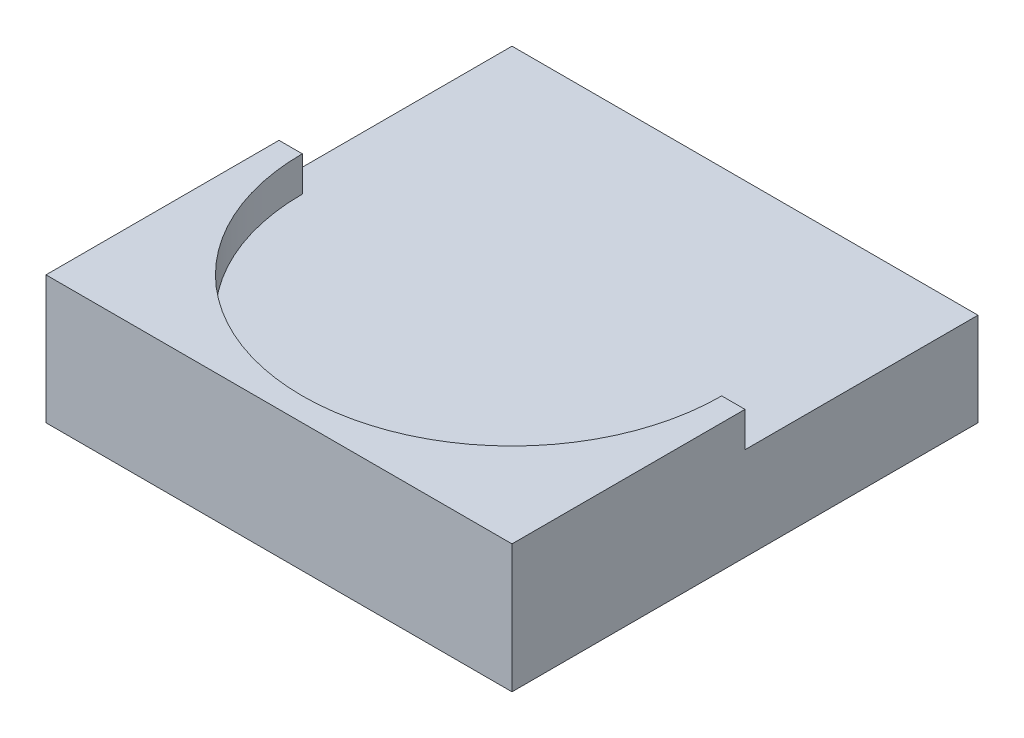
ISO-10303-21;
HEADER;
FILE_DESCRIPTION(('STEP AP214'),'2;1');
FILE_NAME('part.step','',(''),(''),'','','');
FILE_SCHEMA(('AUTOMOTIVE_DESIGN { 1 0 10303 214 1 1 1 1 }'));
ENDSEC;
DATA;
#1=APPLICATION_CONTEXT('core data for automotive mechanical design processes');
#2=APPLICATION_PROTOCOL_DEFINITION('international standard','automotive_design',2000,#1);
#3=PRODUCT_CONTEXT('',#1,'mechanical');
#4=PRODUCT('Part','Part','',(#3));
#5=PRODUCT_RELATED_PRODUCT_CATEGORY('part','',(#4));
#6=PRODUCT_DEFINITION_FORMATION('','',#4);
#7=PRODUCT_DEFINITION_CONTEXT('part definition',#1,'design');
#8=PRODUCT_DEFINITION('design','',#6,#7);
#9=PRODUCT_DEFINITION_SHAPE('','',#8);
#10=(LENGTH_UNIT() NAMED_UNIT(*) SI_UNIT(.MILLI.,.METRE.));
#11=(NAMED_UNIT(*) PLANE_ANGLE_UNIT() SI_UNIT($,.RADIAN.));
#12=(NAMED_UNIT(*) SI_UNIT($,.STERADIAN.) SOLID_ANGLE_UNIT());
#13=UNCERTAINTY_MEASURE_WITH_UNIT(LENGTH_MEASURE(1.E-05),#10,'distance_accuracy_value','');
#14=(GEOMETRIC_REPRESENTATION_CONTEXT(3) GLOBAL_UNCERTAINTY_ASSIGNED_CONTEXT((#13)) GLOBAL_UNIT_ASSIGNED_CONTEXT((#10,
#11,#12)) REPRESENTATION_CONTEXT('',''));
#15=CARTESIAN_POINT('',(0.,0.,0.));
#16=DIRECTION('',(0.,0.,1.));
#17=DIRECTION('',(1.,0.,0.));
#18=AXIS2_PLACEMENT_3D('',#15,#16,#17);
#19=CARTESIAN_POINT('',(0.,1.1,0.));
#20=DIRECTION('',(0.,0.,1.));
#21=DIRECTION('',(1.,0.,0.));
#22=AXIS2_PLACEMENT_3D('',#19,#20,#21);
#23=PLANE('',#22);
#24=DIRECTION('',(-1.,0.,0.));
#25=VECTOR('',#24,1.);
#26=CARTESIAN_POINT('',(0.,0.8,0.));
#27=LINE('',#26,#25);
#28=CARTESIAN_POINT('',(4.,0.8,0.));
#29=VERTEX_POINT('',#28);
#30=CARTESIAN_POINT('',(0.,0.8,0.));
#31=VERTEX_POINT('',#30);
#32=EDGE_CURVE('E145',#29,#31,#27,.T.);
#33=ORIENTED_EDGE('',*,*,#32,.F.);
#34=DIRECTION('',(0.,-1.,0.));
#35=VECTOR('',#34,1.);
#36=CARTESIAN_POINT('',(4.,1.1,0.));
#37=LINE('',#36,#35);
#38=CARTESIAN_POINT('',(4.,0.,0.));
#39=VERTEX_POINT('',#38);
#40=EDGE_CURVE('E88',#29,#39,#37,.T.);
#41=ORIENTED_EDGE('',*,*,#40,.T.);
#42=DIRECTION('',(-1.,0.,0.));
#43=VECTOR('',#42,1.);
#44=CARTESIAN_POINT('',(0.,0.,0.));
#45=LINE('',#44,#43);
#46=CARTESIAN_POINT('',(0.,0.,0.));
#47=VERTEX_POINT('',#46);
#48=EDGE_CURVE('E92',#39,#47,#45,.T.);
#49=ORIENTED_EDGE('',*,*,#48,.T.);
#50=DIRECTION('',(0.,-1.,0.));
#51=VECTOR('',#50,1.);
#52=CARTESIAN_POINT('',(0.,1.1,0.));
#53=LINE('',#52,#51);
#54=EDGE_CURVE('E76',#31,#47,#53,.T.);
#55=ORIENTED_EDGE('',*,*,#54,.F.);
#56=EDGE_LOOP('',(#33,#41,#49,#55));
#57=FACE_BOUND('',#56,.T.);
#58=ADVANCED_FACE('F32',(#57),#23,.F.);
#59=CARTESIAN_POINT('',(0.,1.1,0.));
#60=DIRECTION('',(1.,0.,0.));
#61=DIRECTION('',(0.,0.,-1.));
#62=AXIS2_PLACEMENT_3D('',#59,#60,#61);
#63=PLANE('',#62);
#64=DIRECTION('',(0.,0.,1.));
#65=VECTOR('',#64,1.);
#66=CARTESIAN_POINT('',(0.,1.1,0.));
#67=LINE('',#66,#65);
#68=CARTESIAN_POINT('',(0.,1.1,2.));
#69=VERTEX_POINT('',#68);
#70=CARTESIAN_POINT('',(0.,1.1,4.));
#71=VERTEX_POINT('',#70);
#72=EDGE_CURVE('E97',#69,#71,#67,.T.);
#73=ORIENTED_EDGE('',*,*,#72,.F.);
#74=DIRECTION('',(0.,1.,0.));
#75=VECTOR('',#74,1.);
#76=CARTESIAN_POINT('',(0.,0.8,2.));
#77=LINE('',#76,#75);
#78=CARTESIAN_POINT('',(0.,0.8,2.));
#79=VERTEX_POINT('',#78);
#80=EDGE_CURVE('E105',#79,#69,#77,.T.);
#81=ORIENTED_EDGE('',*,*,#80,.F.);
#82=DIRECTION('',(0.,0.,1.));
#83=VECTOR('',#82,1.);
#84=CARTESIAN_POINT('',(0.,0.8,2.));
#85=LINE('',#84,#83);
#86=EDGE_CURVE('E85',#31,#79,#85,.T.);
#87=ORIENTED_EDGE('',*,*,#86,.F.);
#88=ORIENTED_EDGE('',*,*,#54,.T.);
#89=DIRECTION('',(0.,0.,1.));
#90=VECTOR('',#89,1.);
#91=CARTESIAN_POINT('',(0.,0.,0.));
#92=LINE('',#91,#90);
#93=CARTESIAN_POINT('',(0.,0.,4.));
#94=VERTEX_POINT('',#93);
#95=EDGE_CURVE('E81',#47,#94,#92,.T.);
#96=ORIENTED_EDGE('',*,*,#95,.T.);
#97=DIRECTION('',(0.,-1.,0.));
#98=VECTOR('',#97,1.);
#99=CARTESIAN_POINT('',(0.,1.1,4.));
#100=LINE('',#99,#98);
#101=EDGE_CURVE('E11',#71,#94,#100,.T.);
#102=ORIENTED_EDGE('',*,*,#101,.F.);
#103=EDGE_LOOP('',(#73,#81,#87,#88,#96,#102));
#104=FACE_BOUND('',#103,.T.);
#105=ADVANCED_FACE('F34',(#104),#63,.F.);
#106=CARTESIAN_POINT('',(0.,1.1,4.));
#107=DIRECTION('',(0.,0.,-1.));
#108=DIRECTION('',(-1.,0.,0.));
#109=AXIS2_PLACEMENT_3D('',#106,#107,#108);
#110=PLANE('',#109);
#111=DIRECTION('',(1.,0.,0.));
#112=VECTOR('',#111,1.);
#113=CARTESIAN_POINT('',(0.,0.,4.));
#114=LINE('',#113,#112);
#115=CARTESIAN_POINT('',(4.,0.,4.));
#116=VERTEX_POINT('',#115);
#117=EDGE_CURVE('E101',#94,#116,#114,.T.);
#118=ORIENTED_EDGE('',*,*,#117,.T.);
#119=DIRECTION('',(0.,-1.,0.));
#120=VECTOR('',#119,1.);
#121=CARTESIAN_POINT('',(4.,1.1,4.));
#122=LINE('',#121,#120);
#123=CARTESIAN_POINT('',(4.,1.1,4.));
#124=VERTEX_POINT('',#123);
#125=EDGE_CURVE('E40',#124,#116,#122,.T.);
#126=ORIENTED_EDGE('',*,*,#125,.F.);
#127=DIRECTION('',(1.,0.,0.));
#128=VECTOR('',#127,1.);
#129=CARTESIAN_POINT('',(0.,1.1,4.));
#130=LINE('',#129,#128);
#131=EDGE_CURVE('E56',#71,#124,#130,.T.);
#132=ORIENTED_EDGE('',*,*,#131,.F.);
#133=ORIENTED_EDGE('',*,*,#101,.T.);
#134=EDGE_LOOP('',(#118,#126,#132,#133));
#135=FACE_BOUND('',#134,.T.);
#136=ADVANCED_FACE('F118',(#135),#110,.F.);
#137=CARTESIAN_POINT('',(4.,1.1,0.));
#138=DIRECTION('',(-1.,0.,0.));
#139=DIRECTION('',(0.,0.,1.));
#140=AXIS2_PLACEMENT_3D('',#137,#138,#139);
#141=PLANE('',#140);
#142=DIRECTION('',(0.,0.,-1.));
#143=VECTOR('',#142,1.);
#144=CARTESIAN_POINT('',(4.,0.8,0.));
#145=LINE('',#144,#143);
#146=CARTESIAN_POINT('',(4.,0.8,2.));
#147=VERTEX_POINT('',#146);
#148=EDGE_CURVE('E148',#147,#29,#145,.T.);
#149=ORIENTED_EDGE('',*,*,#148,.F.);
#150=DIRECTION('',(0.,1.,0.));
#151=VECTOR('',#150,1.);
#152=CARTESIAN_POINT('',(4.,0.8,2.));
#153=LINE('',#152,#151);
#154=CARTESIAN_POINT('',(4.,1.1,2.));
#155=VERTEX_POINT('',#154);
#156=EDGE_CURVE('E130',#147,#155,#153,.T.);
#157=ORIENTED_EDGE('',*,*,#156,.T.);
#158=DIRECTION('',(0.,0.,-1.));
#159=VECTOR('',#158,1.);
#160=CARTESIAN_POINT('',(4.,1.1,0.));
#161=LINE('',#160,#159);
#162=EDGE_CURVE('E89',#124,#155,#161,.T.);
#163=ORIENTED_EDGE('',*,*,#162,.F.);
#164=ORIENTED_EDGE('',*,*,#125,.T.);
#165=DIRECTION('',(0.,0.,-1.));
#166=VECTOR('',#165,1.);
#167=CARTESIAN_POINT('',(4.,0.,0.));
#168=LINE('',#167,#166);
#169=EDGE_CURVE('E98',#116,#39,#168,.T.);
#170=ORIENTED_EDGE('',*,*,#169,.T.);
#171=ORIENTED_EDGE('',*,*,#40,.F.);
#172=EDGE_LOOP('',(#149,#157,#163,#164,#170,#171));
#173=FACE_BOUND('',#172,.T.);
#174=ADVANCED_FACE('F115',(#173),#141,.F.);
#175=CARTESIAN_POINT('',(0.,1.1,0.));
#176=DIRECTION('',(0.,1.,0.));
#177=DIRECTION('',(0.,0.,1.));
#178=AXIS2_PLACEMENT_3D('',#175,#176,#177);
#179=PLANE('',#178);
#180=DIRECTION('',(1.,0.,0.));
#181=VECTOR('',#180,1.);
#182=CARTESIAN_POINT('',(0.2,1.1,2.));
#183=LINE('',#182,#181);
#184=CARTESIAN_POINT('',(0.2,1.1,2.));
#185=VERTEX_POINT('',#184);
#186=EDGE_CURVE('E134',#69,#185,#183,.T.);
#187=ORIENTED_EDGE('',*,*,#186,.F.);
#188=ORIENTED_EDGE('',*,*,#72,.T.);
#189=ORIENTED_EDGE('',*,*,#131,.T.);
#190=ORIENTED_EDGE('',*,*,#162,.T.);
#191=DIRECTION('',(1.,0.,0.));
#192=VECTOR('',#191,1.);
#193=CARTESIAN_POINT('',(4.,1.1,2.));
#194=LINE('',#193,#192);
#195=CARTESIAN_POINT('',(3.8,1.1,2.));
#196=VERTEX_POINT('',#195);
#197=EDGE_CURVE('E138',#196,#155,#194,.T.);
#198=ORIENTED_EDGE('',*,*,#197,.F.);
#199=CARTESIAN_POINT('',(2.,1.1,2.));
#200=DIRECTION('',(0.,1.,0.));
#201=DIRECTION('',(0.,0.,1.));
#202=AXIS2_PLACEMENT_3D('',#199,#200,#201);
#203=CIRCLE('',#202,1.8);
#204=EDGE_CURVE('E47',#185,#196,#203,.T.);
#205=ORIENTED_EDGE('',*,*,#204,.F.);
#206=EDGE_LOOP('',(#187,#188,#189,#190,#198,#205));
#207=FACE_BOUND('',#206,.T.);
#208=ADVANCED_FACE('F174',(#207),#179,.T.);
#209=CARTESIAN_POINT('',(0.,0.,0.));
#210=DIRECTION('',(0.,1.,0.));
#211=DIRECTION('',(0.,0.,1.));
#212=AXIS2_PLACEMENT_3D('',#209,#210,#211);
#213=PLANE('',#212);
#214=ORIENTED_EDGE('',*,*,#95,.F.);
#215=ORIENTED_EDGE('',*,*,#48,.F.);
#216=ORIENTED_EDGE('',*,*,#169,.F.);
#217=ORIENTED_EDGE('',*,*,#117,.F.);
#218=EDGE_LOOP('',(#214,#215,#216,#217));
#219=FACE_BOUND('',#218,.T.);
#220=ADVANCED_FACE('F100',(#219),#213,.F.);
#221=CARTESIAN_POINT('',(2.,0.8,2.));
#222=DIRECTION('',(0.,1.,0.));
#223=DIRECTION('',(0.,0.,1.));
#224=AXIS2_PLACEMENT_3D('',#221,#222,#223);
#225=CYLINDRICAL_SURFACE('',#224,1.8);
#226=ORIENTED_EDGE('',*,*,#204,.T.);
#227=DIRECTION('',(0.,1.,0.));
#228=VECTOR('',#227,1.);
#229=CARTESIAN_POINT('',(3.8,0.8,2.));
#230=LINE('',#229,#228);
#231=CARTESIAN_POINT('',(3.8,0.8,2.));
#232=VERTEX_POINT('',#231);
#233=EDGE_CURVE('E128',#232,#196,#230,.T.);
#234=ORIENTED_EDGE('',*,*,#233,.F.);
#235=CARTESIAN_POINT('',(2.,0.8,2.));
#236=DIRECTION('',(0.,1.,0.));
#237=DIRECTION('',(0.,0.,1.));
#238=AXIS2_PLACEMENT_3D('',#235,#236,#237);
#239=CIRCLE('',#238,1.8);
#240=CARTESIAN_POINT('',(0.2,0.8,2.));
#241=VERTEX_POINT('',#240);
#242=EDGE_CURVE('E137',#241,#232,#239,.T.);
#243=ORIENTED_EDGE('',*,*,#242,.F.);
#244=DIRECTION('',(0.,1.,0.));
#245=VECTOR('',#244,1.);
#246=CARTESIAN_POINT('',(0.2,0.8,2.));
#247=LINE('',#246,#245);
#248=EDGE_CURVE('E102',#241,#185,#247,.T.);
#249=ORIENTED_EDGE('',*,*,#248,.T.);
#250=EDGE_LOOP('',(#226,#234,#243,#249));
#251=FACE_BOUND('',#250,.T.);
#252=ADVANCED_FACE('F163',(#251),#225,.F.);
#253=CARTESIAN_POINT('',(0.2,0.8,2.));
#254=DIRECTION('',(0.,0.,1.));
#255=DIRECTION('',(1.,0.,0.));
#256=AXIS2_PLACEMENT_3D('',#253,#254,#255);
#257=PLANE('',#256);
#258=ORIENTED_EDGE('',*,*,#186,.T.);
#259=ORIENTED_EDGE('',*,*,#248,.F.);
#260=DIRECTION('',(1.,0.,0.));
#261=VECTOR('',#260,1.);
#262=CARTESIAN_POINT('',(0.2,0.8,2.));
#263=LINE('',#262,#261);
#264=EDGE_CURVE('E131',#79,#241,#263,.T.);
#265=ORIENTED_EDGE('',*,*,#264,.F.);
#266=ORIENTED_EDGE('',*,*,#80,.T.);
#267=EDGE_LOOP('',(#258,#259,#265,#266));
#268=FACE_BOUND('',#267,.T.);
#269=ADVANCED_FACE('F215',(#268),#257,.F.);
#270=CARTESIAN_POINT('',(4.,0.8,2.));
#271=DIRECTION('',(0.,0.,1.));
#272=DIRECTION('',(1.,0.,0.));
#273=AXIS2_PLACEMENT_3D('',#270,#271,#272);
#274=PLANE('',#273);
#275=ORIENTED_EDGE('',*,*,#197,.T.);
#276=ORIENTED_EDGE('',*,*,#156,.F.);
#277=DIRECTION('',(1.,0.,0.));
#278=VECTOR('',#277,1.);
#279=CARTESIAN_POINT('',(4.,0.8,2.));
#280=LINE('',#279,#278);
#281=EDGE_CURVE('E151',#232,#147,#280,.T.);
#282=ORIENTED_EDGE('',*,*,#281,.F.);
#283=ORIENTED_EDGE('',*,*,#233,.T.);
#284=EDGE_LOOP('',(#275,#276,#282,#283));
#285=FACE_BOUND('',#284,.T.);
#286=ADVANCED_FACE('F173',(#285),#274,.F.);
#287=CARTESIAN_POINT('',(2.,0.8,2.));
#288=DIRECTION('',(0.,1.,0.));
#289=DIRECTION('',(0.,0.,1.));
#290=AXIS2_PLACEMENT_3D('',#287,#288,#289);
#291=PLANE('',#290);
#292=ORIENTED_EDGE('',*,*,#242,.T.);
#293=ORIENTED_EDGE('',*,*,#281,.T.);
#294=ORIENTED_EDGE('',*,*,#148,.T.);
#295=ORIENTED_EDGE('',*,*,#32,.T.);
#296=ORIENTED_EDGE('',*,*,#86,.T.);
#297=ORIENTED_EDGE('',*,*,#264,.T.);
#298=EDGE_LOOP('',(#292,#293,#294,#295,#296,#297));
#299=FACE_BOUND('',#298,.T.);
#300=ADVANCED_FACE('F158',(#299),#291,.T.);
#301=CLOSED_SHELL('',(#58,#105,#136,#174,#208,#220,#252,#269,#286,#300));
#302=MANIFOLD_SOLID_BREP('B2',#301);
#303=ADVANCED_BREP_SHAPE_REPRESENTATION('',(#18,#302),#14);
#304=SHAPE_DEFINITION_REPRESENTATION(#9,#303);
ENDSEC;
END-ISO-10303-21;
